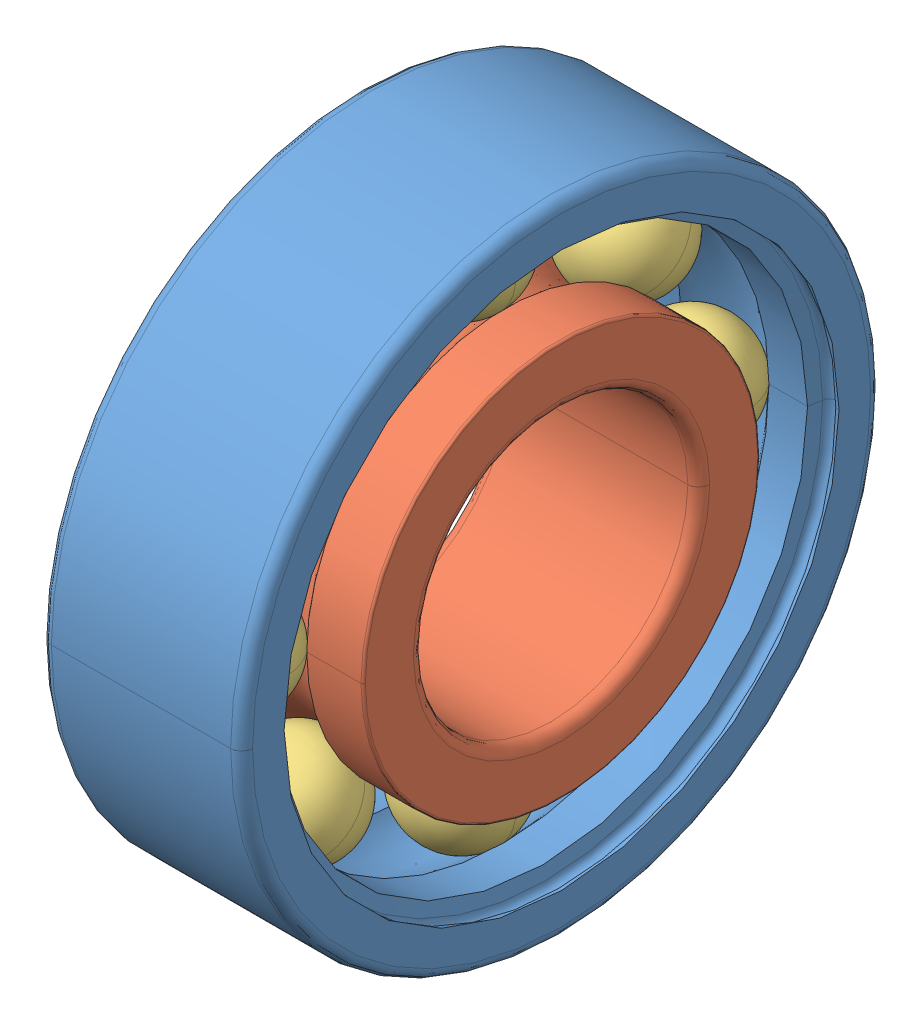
SolidWorks assembly 6202_VA201.sldasm, configuration Default (file format 11000). Lengths in mm.
Overall size (11 35 35).
10 component instances, 3 part files, 0 mates.
Components (placement in the parent):
- _6202_VA201_PART1_2-1: _6202_VA201_PART1_2.sldprt [Default] at origin size (11 35 35)
- _6202_VA201_PART2_4-1: _6202_VA201_PART2_4.sldprt [Default] at origin size (11 21.7 21.7)
- _6202_VA201_PART5_10-1: _6202_VA201_PART5_10.sldprt [Default] at origin size (6 6 6)
- _6202_VA201_PART5_10-2: _6202_VA201_PART5_10.sldprt [Default] x (1 0 0) z (0 0.707107 0.707107) size (6 6 6)
- _6202_VA201_PART5_10-3: _6202_VA201_PART5_10.sldprt [Default] x (1 0 0) z (0 1 0) size (6 6 6)
- _6202_VA201_PART5_10-4: _6202_VA201_PART5_10.sldprt [Default] x (1 0 0) z (0 0.707107 -0.707107) size (6 6 6)
- _6202_VA201_PART5_10-5: _6202_VA201_PART5_10.sldprt [Default] x (1 0 0) z (0 0 -1) size (6 6 6)
- _6202_VA201_PART5_10-6: _6202_VA201_PART5_10.sldprt [Default] x (1 0 0) z (0 -0.707107 -0.707107) size (6 6 6)
- _6202_VA201_PART5_10-7: _6202_VA201_PART5_10.sldprt [Default] x (1 0 0) z (0 -1 0) size (6 6 6)
- _6202_VA201_PART5_10-8: _6202_VA201_PART5_10.sldprt [Default] x (1 0 0) z (0 -0.707107 0.707107) size (6 6 6)
